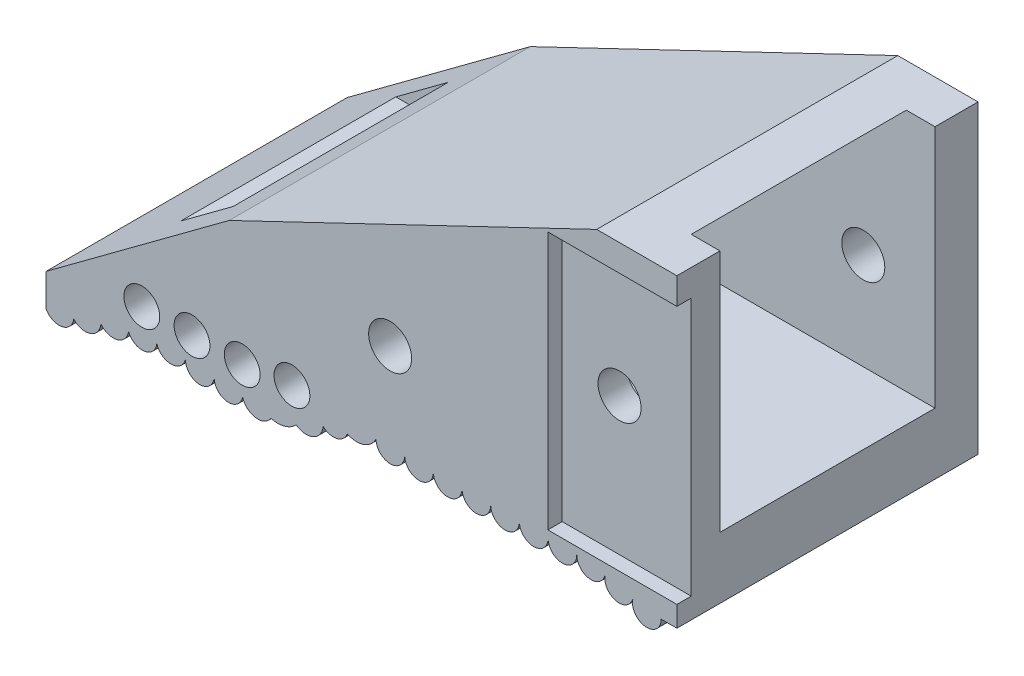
from build123d import *

# Parameters (mm, degrees)
SKETCH_1_W          = 44
SKETCH_1_H          = 25
EXTRUDE_1_DEPTH     = 3
EXTRUDE_2_DEPTH     = 15
SKETCH_3_W          = 44
SKETCH_3_H          = 25
EXTRUDE_3_DEPTH     = 3
SKETCH_4_OUTSIDE_W  = 56.958
SKETCH_4_OUTSIDE_H  = 37.958
CUT_EXTRUDE_1_DEPTH = 30
SKETCH_5_R          = 1.5
CUT_EXTRUDE_2_DEPTH = 30
SKETCH_6_R          = 1.5
CUT_EXTRUDE_3_DEPTH = 30
SKETCH_7_W          = 9
SKETCH_7_H          = 18
CUT_EXTRUDE_6_DEPTH = 1
SKETCH_8_R          = 1.25
CUT_EXTRUDE_7_DEPTH = 30


with BuildPart() as part:
    # Sketch 1 → Extrude 1 (new body)
    with BuildSketch(Plane.XY):
        with Locations((9.221698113, -4.932075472)):
            Rectangle(SKETCH_1_W, SKETCH_1_H)
    extrude(amount=EXTRUDE_1_DEPTH)

    # Sketch 2 → Extrude 2 (add)
    with BuildSketch(Plane.XY.offset(3)):
        Polygon((-8.778301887, -9.432075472), (31.221698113, -9.432075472), (31.221698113, -17.432075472), (-12.778301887, -17.432075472), (-12.778301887, 7.567924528), (29.221698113, 7.567924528), align=None)
    extrude(amount=EXTRUDE_2_DEPTH)

    # Sketch 3 → Extrude 3 (add)
    with BuildSketch(Plane.XY.offset(18)):
        with Locations((9.221698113, -4.932075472)):
            Rectangle(SKETCH_3_W, SKETCH_3_H)
    extrude(amount=EXTRUDE_3_DEPTH)

    # Sketch 4 outside → Cut-Extrude 1 (cut)
    with BuildSketch(Plane.XY.offset(21)):
        with Locations((9.222, -4.932)):
            Rectangle(SKETCH_4_OUTSIDE_W, SKETCH_4_OUTSIDE_H)
        with BuildLine():
            Line((0, -4.704131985), (-12.778301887, -14.170796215))
            Line((-12.778301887, -14.170796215), (-12.778301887, -16.432075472))
            ThreePointArc((-12.778301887, -16.432075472), (-11.683885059, -16.955812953), (-10.841254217, -16.082874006))
            ThreePointArc((-10.841254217, -16.082874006), (-9.682626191, -16.374535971), (-8.951584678, -15.429515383))
            ThreePointArc((-8.951584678, -15.429515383), (-7.815500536, -15.812514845), (-7.017721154, -14.917571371))
            ThreePointArc((-7.017721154, -14.917571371), (-5.934732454, -15.566074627), (-5.049134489, -14.666554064))
            ThreePointArc((-5.049134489, -14.666554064), (-4.028561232, -15.410161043), (-3.048843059, -14.613497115))
            ThreePointArc((-3.048843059, -14.613497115), (-2.084202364, -15.645515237), (-1.050130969, -14.683075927))
            ThreePointArc((-1.050130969, -14.683075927), (-0.154753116, -15.714579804), (0.934546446, -14.890487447))
            ThreePointArc((0.934546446, -14.890487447), (1.820834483, -15.692601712), (2.910143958, -15.200363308))
            ThreePointArc((2.910143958, -15.200363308), (3.858435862, -15.202893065), (4.674247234, -14.719451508))
            ThreePointArc((4.674247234, -14.719451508), (5.859175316, -14.838887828), (6.55334804, -13.871187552))
            ThreePointArc((6.55334804, -13.871187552), (7.501593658, -14.125868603), (8.238004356, -13.476460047))
            ThreePointArc((8.238004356, -13.476460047), (9.380760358, -13.545294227), (10.237483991, -12.785916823))
            ThreePointArc((10.237483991, -12.785916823), (11.237483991, -13.785916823), (12.237483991, -12.785916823))
            ThreePointArc((12.237483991, -12.785916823), (13.237483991, -13.785916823), (14.237483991, -12.785916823))
            ThreePointArc((14.237483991, -12.785916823), (15.237483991, -13.785916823), (16.237483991, -12.785916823))
            ThreePointArc((16.237483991, -12.785916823), (17.237483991, -13.785916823), (18.237483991, -12.785916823))
            ThreePointArc((18.237483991, -12.785916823), (19.237483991, -13.785916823), (20.237483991, -12.785916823))
            ThreePointArc((20.237483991, -12.785916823), (21.237483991, -13.785916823), (22.237483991, -12.785916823))
            ThreePointArc((22.237483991, -12.785916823), (23.237483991, -13.785916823), (24.237483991, -12.785916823))
            ThreePointArc((24.237483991, -12.785916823), (25.129833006, -13.780105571), (26.214306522, -12.99996762))
            ThreePointArc((26.214306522, -12.99996762), (26.956417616, -14.186083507), (28.157999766, -13.46928499))
            ThreePointArc((28.157999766, -13.46928499), (28.996166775, -14.716234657), (30.124870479, -13.724551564))
            Line((30.124870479, -13.724551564), (31.221698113, -13.724551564))
            Line((31.221698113, -13.724551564), (31.221698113, 7.567924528))
            Line((31.221698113, 7.567924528), (25.626938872, 7.567924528))
            Line((25.626938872, 7.567924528), (0, -4.704131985))
        make_face(mode=Mode.SUBTRACT)
    extrude(amount=-CUT_EXTRUDE_1_DEPTH, mode=Mode.SUBTRACT)

    # Sketch 5 → Cut-Extrude 2 (cut)
    with BuildSketch(Plane.XY.offset(21)):
        with Locations((26.221698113, -2.682075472)):
            Circle(SKETCH_5_R)
    extrude(amount=-CUT_EXTRUDE_2_DEPTH, mode=Mode.SUBTRACT)

    # Sketch 6 → Cut-Extrude 3 (cut)
    with BuildSketch(Plane.XY.offset(21)):
        with Locations((11.221698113, -6.682075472)):
            Circle(SKETCH_6_R)
    extrude(amount=-CUT_EXTRUDE_3_DEPTH, mode=Mode.SUBTRACT)

    # Sketch 7 → Cut-Extrude 6 (cut)
    with BuildSketch(Plane.XY.offset(21)):
        with Locations((26.721698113, -3.284503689)):
            Rectangle(SKETCH_7_W, SKETCH_7_H)
    extrude(amount=-CUT_EXTRUDE_6_DEPTH, mode=Mode.SUBTRACT)

    # Sketch 8 → Cut-Extrude 7 (cut)
    with BuildSketch(Plane.XY.offset(21)):
        with Locations((-6.095292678, -12.953337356)):
            Circle(SKETCH_8_R)
        with Locations((-2.595292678, -12.953337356)):
            Circle(SKETCH_8_R)
        with Locations((0.904707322, -12.953337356)):
            Circle(SKETCH_8_R)
        with Locations((4.373632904, -12.487982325)):
            Circle(SKETCH_8_R)
    extrude(amount=-CUT_EXTRUDE_7_DEPTH, mode=Mode.SUBTRACT)


solid = part.part
